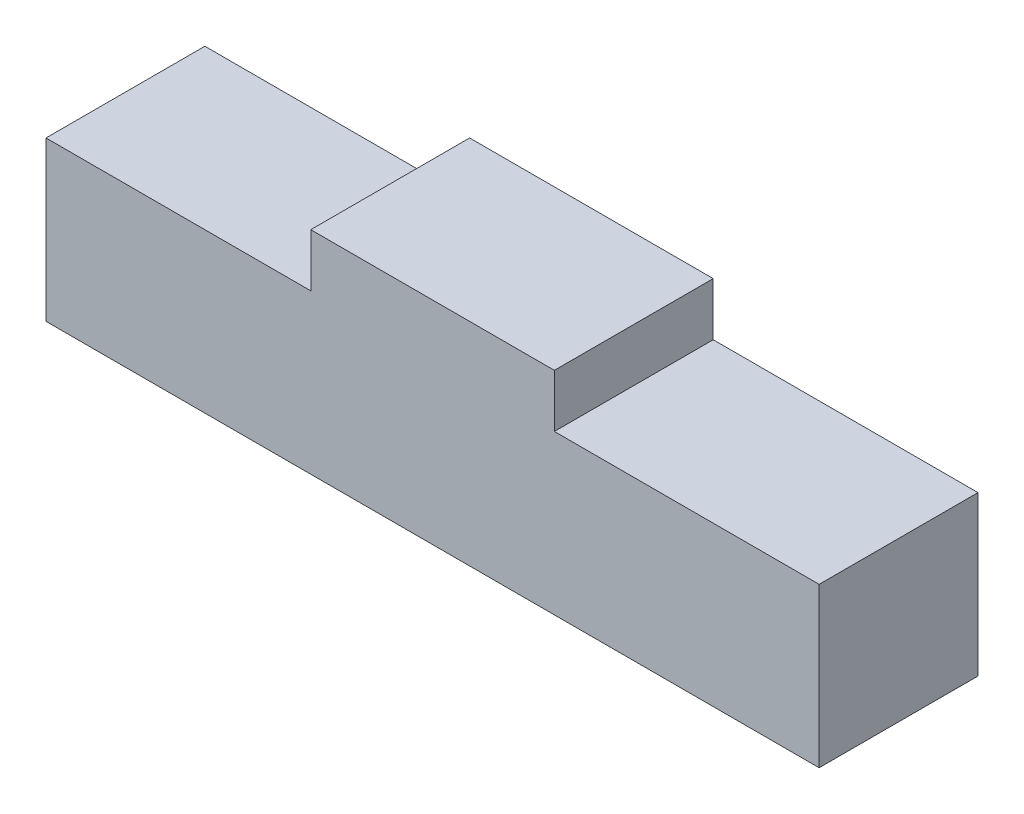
from build123d import *

# Parameters (mm, degrees)
EXTRUSION1_DEPTH = 3


with BuildPart() as part:
    # Esquisse1 → Extrusion1 (new body)
    with BuildSketch(Plane.XY):
        Polygon((0, 0), (-7.3, 0), (-7.3, 3), (-2.3, 3), (-2.3, 4), (0, 4), align=None)
    extrude(amount=EXTRUSION1_DEPTH)

    # Sym_trie1: part across plane


with BuildPart() as part_1:
    add(part.part)
    add(part.part.mirror(Plane(origin=(0, 4, 3), x_dir=(0, 0, 1), z_dir=(-1, 0, 0))))


solid = part_1.part
